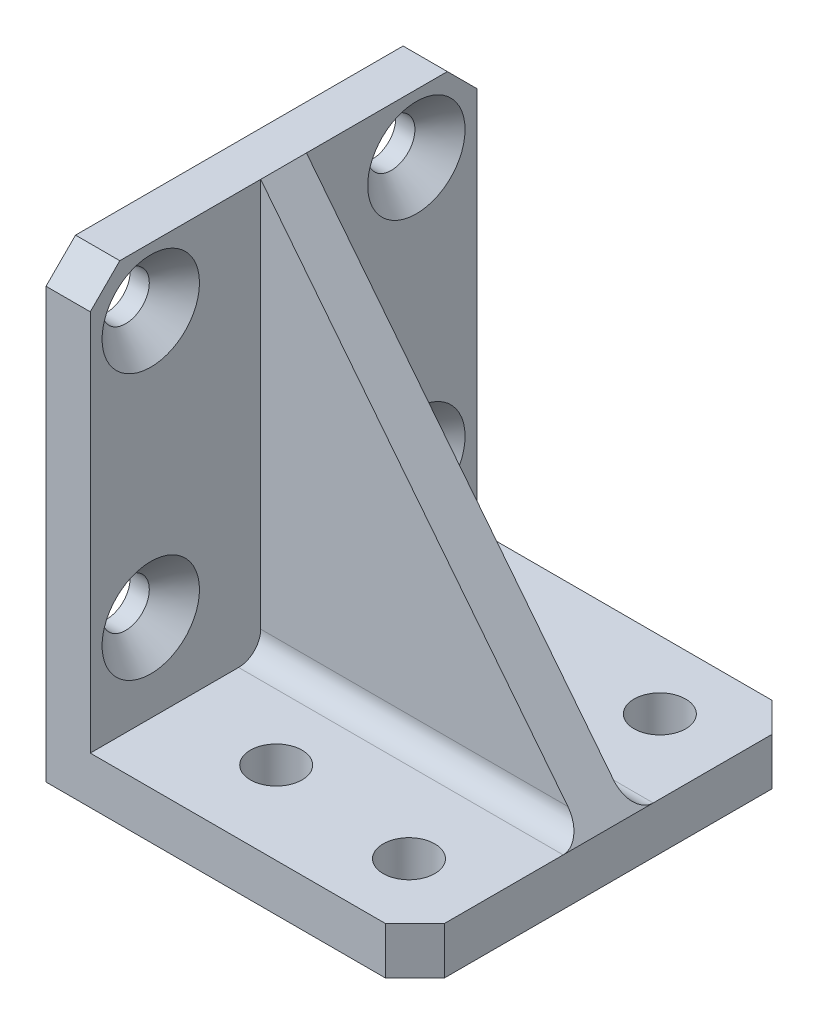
ISO-10303-21;
HEADER;
FILE_DESCRIPTION(('STEP AP214'),'2;1');
FILE_NAME('part.step','',(''),(''),'','','');
FILE_SCHEMA(('AUTOMOTIVE_DESIGN { 1 0 10303 214 1 1 1 1 }'));
ENDSEC;
DATA;
#1=APPLICATION_CONTEXT('core data for automotive mechanical design processes');
#2=APPLICATION_PROTOCOL_DEFINITION('international standard','automotive_design',2000,#1);
#3=PRODUCT_CONTEXT('',#1,'mechanical');
#4=PRODUCT('Part','Part','',(#3));
#5=PRODUCT_RELATED_PRODUCT_CATEGORY('part','',(#4));
#6=PRODUCT_DEFINITION_FORMATION('','',#4);
#7=PRODUCT_DEFINITION_CONTEXT('part definition',#1,'design');
#8=PRODUCT_DEFINITION('design','',#6,#7);
#9=PRODUCT_DEFINITION_SHAPE('','',#8);
#10=(LENGTH_UNIT() NAMED_UNIT(*) SI_UNIT(.MILLI.,.METRE.));
#11=(NAMED_UNIT(*) PLANE_ANGLE_UNIT() SI_UNIT($,.RADIAN.));
#12=(NAMED_UNIT(*) SI_UNIT($,.STERADIAN.) SOLID_ANGLE_UNIT());
#13=UNCERTAINTY_MEASURE_WITH_UNIT(LENGTH_MEASURE(1.E-05),#10,'distance_accuracy_value','');
#14=(GEOMETRIC_REPRESENTATION_CONTEXT(3) GLOBAL_UNCERTAINTY_ASSIGNED_CONTEXT((#13)) GLOBAL_UNIT_ASSIGNED_CONTEXT((#10,
#11,#12)) REPRESENTATION_CONTEXT('',''));
#15=CARTESIAN_POINT('',(0.,0.,0.));
#16=DIRECTION('',(0.,0.,1.));
#17=DIRECTION('',(1.,0.,0.));
#18=AXIS2_PLACEMENT_3D('',#15,#16,#17);
#19=CARTESIAN_POINT('',(3.,3.2,13.1));
#20=DIRECTION('',(-1.,0.,0.));
#21=DIRECTION('',(0.,0.,1.));
#22=AXIS2_PLACEMENT_3D('',#19,#20,#21);
#23=PLANE('',#22);
#24=CARTESIAN_POINT('',(3.,27.1,-9.));
#25=DIRECTION('',(1.,0.,0.));
#26=DIRECTION('',(0.,0.,-1.));
#27=AXIS2_PLACEMENT_3D('',#24,#25,#26);
#28=CIRCLE('',#27,3.3);
#29=CARTESIAN_POINT('',(3.,27.1,-12.3));
#30=VERTEX_POINT('',#29);
#31=EDGE_CURVE('E660',#30,#30,#28,.T.);
#32=ORIENTED_EDGE('',*,*,#31,.F.);
#33=EDGE_LOOP('',(#32));
#34=FACE_BOUND('',#33,.T.);
#35=DIRECTION('',(0.,-1.,0.));
#36=VECTOR('',#35,1.);
#37=CARTESIAN_POINT('',(3.,31.1,-1.55));
#38=LINE('',#37,#36);
#39=CARTESIAN_POINT('',(3.,31.1,-1.55));
#40=VERTEX_POINT('',#39);
#41=CARTESIAN_POINT('',(3.,4.7,-1.55));
#42=VERTEX_POINT('',#41);
#43=EDGE_CURVE('E112',#40,#42,#38,.T.);
#44=ORIENTED_EDGE('',*,*,#43,.T.);
#45=CARTESIAN_POINT('',(3.,4.7,-3.05));
#46=DIRECTION('',(-1.,0.,0.));
#47=DIRECTION('',(0.,0.,1.));
#48=AXIS2_PLACEMENT_3D('',#45,#46,#47);
#49=CIRCLE('',#48,1.5);
#50=CARTESIAN_POINT('',(3.,3.2,-3.05));
#51=VERTEX_POINT('',#50);
#52=EDGE_CURVE('E105',#42,#51,#49,.F.);
#53=ORIENTED_EDGE('',*,*,#52,.T.);
#54=DIRECTION('',(0.,0.,-1.));
#55=VECTOR('',#54,1.);
#56=CARTESIAN_POINT('',(3.,3.2,13.1));
#57=LINE('',#56,#55);
#58=CARTESIAN_POINT('',(3.,3.2,-13.1));
#59=VERTEX_POINT('',#58);
#60=EDGE_CURVE('E190',#51,#59,#57,.T.);
#61=ORIENTED_EDGE('',*,*,#60,.T.);
#62=DIRECTION('',(0.,1.,0.));
#63=VECTOR('',#62,1.);
#64=CARTESIAN_POINT('',(3.,3.2,-13.1));
#65=LINE('',#64,#63);
#66=CARTESIAN_POINT('',(3.,29.1,-13.1));
#67=VERTEX_POINT('',#66);
#68=EDGE_CURVE('E166',#59,#67,#65,.T.);
#69=ORIENTED_EDGE('',*,*,#68,.T.);
#70=DIRECTION('',(0.,-0.707106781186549,-0.707106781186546));
#71=VECTOR('',#70,1.);
#72=CARTESIAN_POINT('',(3.,31.1,-11.1));
#73=LINE('',#72,#71);
#74=CARTESIAN_POINT('',(3.,31.1,-11.1));
#75=VERTEX_POINT('',#74);
#76=EDGE_CURVE('E228',#67,#75,#73,.F.);
#77=ORIENTED_EDGE('',*,*,#76,.T.);
#78=DIRECTION('',(0.,0.,-1.));
#79=VECTOR('',#78,1.);
#80=CARTESIAN_POINT('',(3.,31.1,13.1));
#81=LINE('',#80,#79);
#82=EDGE_CURVE('E187',#40,#75,#81,.T.);
#83=ORIENTED_EDGE('',*,*,#82,.F.);
#84=EDGE_LOOP('',(#44,#53,#61,#69,#77,#83));
#85=FACE_BOUND('',#84,.T.);
#86=CARTESIAN_POINT('',(3.,9.1,-9.));
#87=DIRECTION('',(1.,0.,0.));
#88=DIRECTION('',(0.,0.,-1.));
#89=AXIS2_PLACEMENT_3D('',#86,#87,#88);
#90=CIRCLE('',#89,3.3);
#91=CARTESIAN_POINT('',(3.,9.1,-12.3));
#92=VERTEX_POINT('',#91);
#93=EDGE_CURVE('E650',#92,#92,#90,.T.);
#94=ORIENTED_EDGE('',*,*,#93,.F.);
#95=EDGE_LOOP('',(#94));
#96=FACE_BOUND('',#95,.T.);
#97=ADVANCED_FACE('F34',(#34,#85,#96),#23,.F.);
#98=CARTESIAN_POINT('',(3.,9.1,9.));
#99=DIRECTION('',(1.,0.,0.));
#100=DIRECTION('',(0.,0.,-1.));
#101=AXIS2_PLACEMENT_3D('',#98,#99,#100);
#102=CIRCLE('',#101,3.3);
#103=CARTESIAN_POINT('',(3.,9.1,5.7));
#104=VERTEX_POINT('',#103);
#105=EDGE_CURVE('E665',#104,#104,#102,.T.);
#106=ORIENTED_EDGE('',*,*,#105,.F.);
#107=EDGE_LOOP('',(#106));
#108=FACE_BOUND('',#107,.T.);
#109=CARTESIAN_POINT('',(3.,3.2,13.1));
#110=VERTEX_POINT('',#109);
#111=CARTESIAN_POINT('',(3.,3.2,3.05));
#112=VERTEX_POINT('',#111);
#113=EDGE_CURVE('E191',#110,#112,#57,.T.);
#114=ORIENTED_EDGE('',*,*,#113,.T.);
#115=CARTESIAN_POINT('',(3.,4.7,3.05));
#116=DIRECTION('',(-1.,0.,0.));
#117=DIRECTION('',(0.,0.,1.));
#118=AXIS2_PLACEMENT_3D('',#115,#116,#117);
#119=CIRCLE('',#118,1.5);
#120=CARTESIAN_POINT('',(3.,4.7,1.55));
#121=VERTEX_POINT('',#120);
#122=EDGE_CURVE('E253',#112,#121,#119,.F.);
#123=ORIENTED_EDGE('',*,*,#122,.T.);
#124=DIRECTION('',(0.,-1.,0.));
#125=VECTOR('',#124,1.);
#126=CARTESIAN_POINT('',(3.,31.1,1.55));
#127=LINE('',#126,#125);
#128=CARTESIAN_POINT('',(3.,31.1,1.55));
#129=VERTEX_POINT('',#128);
#130=EDGE_CURVE('E104',#129,#121,#127,.T.);
#131=ORIENTED_EDGE('',*,*,#130,.F.);
#132=CARTESIAN_POINT('',(3.,31.1,11.1));
#133=VERTEX_POINT('',#132);
#134=EDGE_CURVE('E188',#133,#129,#81,.T.);
#135=ORIENTED_EDGE('',*,*,#134,.F.);
#136=DIRECTION('',(0.,-0.707106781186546,0.707106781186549));
#137=VECTOR('',#136,1.);
#138=CARTESIAN_POINT('',(3.,29.1,13.1));
#139=LINE('',#138,#137);
#140=CARTESIAN_POINT('',(3.,29.1,13.1));
#141=VERTEX_POINT('',#140);
#142=EDGE_CURVE('E219',#133,#141,#139,.T.);
#143=ORIENTED_EDGE('',*,*,#142,.T.);
#144=DIRECTION('',(0.,1.,0.));
#145=VECTOR('',#144,1.);
#146=CARTESIAN_POINT('',(3.,3.2,13.1));
#147=LINE('',#146,#145);
#148=EDGE_CURVE('E172',#110,#141,#147,.T.);
#149=ORIENTED_EDGE('',*,*,#148,.F.);
#150=EDGE_LOOP('',(#114,#123,#131,#135,#143,#149));
#151=FACE_BOUND('',#150,.T.);
#152=CARTESIAN_POINT('',(3.,27.1,9.));
#153=DIRECTION('',(1.,0.,0.));
#154=DIRECTION('',(0.,0.,-1.));
#155=AXIS2_PLACEMENT_3D('',#152,#153,#154);
#156=CIRCLE('',#155,3.3);
#157=CARTESIAN_POINT('',(3.,27.1,5.7));
#158=VERTEX_POINT('',#157);
#159=EDGE_CURVE('E652',#158,#158,#156,.T.);
#160=ORIENTED_EDGE('',*,*,#159,.F.);
#161=EDGE_LOOP('',(#160));
#162=FACE_BOUND('',#161,.T.);
#163=ADVANCED_FACE('F327',(#108,#151,#162),#23,.F.);
#164=CARTESIAN_POINT('',(25.,3.2,13.1));
#165=DIRECTION('',(0.,-1.,0.));
#166=DIRECTION('',(1.,0.,0.));
#167=AXIS2_PLACEMENT_3D('',#164,#165,#166);
#168=PLANE('',#167);
#169=CARTESIAN_POINT('',(20.,3.2,8.5));
#170=DIRECTION('',(0.,-1.,0.));
#171=DIRECTION('',(1.,0.,0.));
#172=AXIS2_PLACEMENT_3D('',#169,#170,#171);
#173=CIRCLE('',#172,1.75);
#174=CARTESIAN_POINT('',(21.75,3.2,8.5));
#175=VERTEX_POINT('',#174);
#176=EDGE_CURVE('E146',#175,#175,#173,.F.);
#177=ORIENTED_EDGE('',*,*,#176,.F.);
#178=EDGE_LOOP('',(#177));
#179=FACE_BOUND('',#178,.T.);
#180=CARTESIAN_POINT('',(10.,3.2,7.5));
#181=DIRECTION('',(0.,-1.,0.));
#182=DIRECTION('',(1.,0.,0.));
#183=AXIS2_PLACEMENT_3D('',#180,#181,#182);
#184=CIRCLE('',#183,1.75);
#185=CARTESIAN_POINT('',(11.75,3.2,7.5));
#186=VERTEX_POINT('',#185);
#187=EDGE_CURVE('E152',#186,#186,#184,.F.);
#188=ORIENTED_EDGE('',*,*,#187,.F.);
#189=EDGE_LOOP('',(#188));
#190=FACE_BOUND('',#189,.T.);
#191=DIRECTION('',(0.,0.,-1.));
#192=VECTOR('',#191,1.);
#193=CARTESIAN_POINT('',(25.,3.2,13.1));
#194=LINE('',#193,#192);
#195=CARTESIAN_POINT('',(25.,3.2,11.1));
#196=VERTEX_POINT('',#195);
#197=CARTESIAN_POINT('',(25.,3.2,3.05));
#198=VERTEX_POINT('',#197);
#199=EDGE_CURVE('E194',#196,#198,#194,.T.);
#200=ORIENTED_EDGE('',*,*,#199,.T.);
#201=DIRECTION('',(1.,0.,0.));
#202=VECTOR('',#201,1.);
#203=CARTESIAN_POINT('',(3.,3.2,3.05));
#204=LINE('',#203,#202);
#205=EDGE_CURVE('E57',#198,#112,#204,.F.);
#206=ORIENTED_EDGE('',*,*,#205,.T.);
#207=ORIENTED_EDGE('',*,*,#113,.F.);
#208=DIRECTION('',(-1.,0.,0.));
#209=VECTOR('',#208,1.);
#210=CARTESIAN_POINT('',(25.,3.2,13.1));
#211=LINE('',#210,#209);
#212=CARTESIAN_POINT('',(23.,3.2,13.1));
#213=VERTEX_POINT('',#212);
#214=EDGE_CURVE('E169',#213,#110,#211,.T.);
#215=ORIENTED_EDGE('',*,*,#214,.F.);
#216=DIRECTION('',(0.707106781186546,0.,-0.707106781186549));
#217=VECTOR('',#216,1.);
#218=CARTESIAN_POINT('',(23.,3.2,13.1));
#219=LINE('',#218,#217);
#220=EDGE_CURVE('E243',#213,#196,#219,.T.);
#221=ORIENTED_EDGE('',*,*,#220,.T.);
#222=EDGE_LOOP('',(#200,#206,#207,#215,#221));
#223=FACE_BOUND('',#222,.T.);
#224=ADVANCED_FACE('F345',(#179,#190,#223),#168,.F.);
#225=CARTESIAN_POINT('',(0.,31.1,13.1));
#226=DIRECTION('',(1.,0.,0.));
#227=DIRECTION('',(0.,1.,0.));
#228=AXIS2_PLACEMENT_3D('',#225,#226,#227);
#229=PLANE('',#228);
#230=CARTESIAN_POINT('',(0.,9.1,9.));
#231=DIRECTION('',(-1.,0.,0.));
#232=DIRECTION('',(0.,-1.,0.));
#233=AXIS2_PLACEMENT_3D('',#230,#231,#232);
#234=CIRCLE('',#233,1.6);
#235=CARTESIAN_POINT('',(0.,7.5,9.));
#236=VERTEX_POINT('',#235);
#237=EDGE_CURVE('E125',#236,#236,#234,.T.);
#238=ORIENTED_EDGE('',*,*,#237,.F.);
#239=EDGE_LOOP('',(#238));
#240=FACE_BOUND('',#239,.T.);
#241=CARTESIAN_POINT('',(0.,9.1,-9.));
#242=DIRECTION('',(-1.,0.,0.));
#243=DIRECTION('',(0.,-1.,0.));
#244=AXIS2_PLACEMENT_3D('',#241,#242,#243);
#245=CIRCLE('',#244,1.6);
#246=CARTESIAN_POINT('',(0.,7.5,-9.));
#247=VERTEX_POINT('',#246);
#248=EDGE_CURVE('E128',#247,#247,#245,.T.);
#249=ORIENTED_EDGE('',*,*,#248,.F.);
#250=EDGE_LOOP('',(#249));
#251=FACE_BOUND('',#250,.T.);
#252=CARTESIAN_POINT('',(0.,27.1,9.));
#253=DIRECTION('',(-1.,0.,0.));
#254=DIRECTION('',(0.,-1.,0.));
#255=AXIS2_PLACEMENT_3D('',#252,#253,#254);
#256=CIRCLE('',#255,1.6);
#257=CARTESIAN_POINT('',(0.,25.5,9.));
#258=VERTEX_POINT('',#257);
#259=EDGE_CURVE('E131',#258,#258,#256,.T.);
#260=ORIENTED_EDGE('',*,*,#259,.F.);
#261=EDGE_LOOP('',(#260));
#262=FACE_BOUND('',#261,.T.);
#263=CARTESIAN_POINT('',(0.,27.1,-9.));
#264=DIRECTION('',(-1.,0.,0.));
#265=DIRECTION('',(0.,-1.,0.));
#266=AXIS2_PLACEMENT_3D('',#263,#264,#265);
#267=CIRCLE('',#266,1.6);
#268=CARTESIAN_POINT('',(0.,25.5,-9.));
#269=VERTEX_POINT('',#268);
#270=EDGE_CURVE('E134',#269,#269,#267,.T.);
#271=ORIENTED_EDGE('',*,*,#270,.F.);
#272=EDGE_LOOP('',(#271));
#273=FACE_BOUND('',#272,.T.);
#274=DIRECTION('',(0.,-1.,0.));
#275=VECTOR('',#274,1.);
#276=CARTESIAN_POINT('',(0.,31.1,13.1));
#277=LINE('',#276,#275);
#278=CARTESIAN_POINT('',(0.,29.1,13.1));
#279=VERTEX_POINT('',#278);
#280=CARTESIAN_POINT('',(0.,0.,13.1));
#281=VERTEX_POINT('',#280);
#282=EDGE_CURVE('E162',#279,#281,#277,.T.);
#283=ORIENTED_EDGE('',*,*,#282,.F.);
#284=DIRECTION('',(0.,0.707106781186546,-0.707106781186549));
#285=VECTOR('',#284,1.);
#286=CARTESIAN_POINT('',(0.,29.1,13.1));
#287=LINE('',#286,#285);
#288=CARTESIAN_POINT('',(0.,31.1,11.1));
#289=VERTEX_POINT('',#288);
#290=EDGE_CURVE('E210',#279,#289,#287,.T.);
#291=ORIENTED_EDGE('',*,*,#290,.T.);
#292=DIRECTION('',(0.,0.,-1.));
#293=VECTOR('',#292,1.);
#294=CARTESIAN_POINT('',(0.,31.1,13.1));
#295=LINE('',#294,#293);
#296=CARTESIAN_POINT('',(0.,31.1,-11.1));
#297=VERTEX_POINT('',#296);
#298=EDGE_CURVE('E175',#289,#297,#295,.T.);
#299=ORIENTED_EDGE('',*,*,#298,.T.);
#300=DIRECTION('',(0.,0.707106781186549,0.707106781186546));
#301=VECTOR('',#300,1.);
#302=CARTESIAN_POINT('',(0.,31.1,-11.1));
#303=LINE('',#302,#301);
#304=CARTESIAN_POINT('',(0.,29.1,-13.1));
#305=VERTEX_POINT('',#304);
#306=EDGE_CURVE('E207',#297,#305,#303,.F.);
#307=ORIENTED_EDGE('',*,*,#306,.T.);
#308=DIRECTION('',(0.,-1.,0.));
#309=VECTOR('',#308,1.);
#310=CARTESIAN_POINT('',(0.,31.1,-13.1));
#311=LINE('',#310,#309);
#312=CARTESIAN_POINT('',(0.,0.,-13.1));
#313=VERTEX_POINT('',#312);
#314=EDGE_CURVE('E161',#305,#313,#311,.T.);
#315=ORIENTED_EDGE('',*,*,#314,.T.);
#316=DIRECTION('',(0.,0.,-1.));
#317=VECTOR('',#316,1.);
#318=CARTESIAN_POINT('',(0.,0.,13.1));
#319=LINE('',#318,#317);
#320=EDGE_CURVE('E198',#281,#313,#319,.T.);
#321=ORIENTED_EDGE('',*,*,#320,.F.);
#322=EDGE_LOOP('',(#283,#291,#299,#307,#315,#321));
#323=FACE_BOUND('',#322,.T.);
#324=ADVANCED_FACE('F306',(#240,#251,#262,#273,#323),#229,.F.);
#325=CARTESIAN_POINT('',(0.,0.,13.1));
#326=DIRECTION('',(0.,1.,0.));
#327=DIRECTION('',(0.,0.,1.));
#328=AXIS2_PLACEMENT_3D('',#325,#326,#327);
#329=PLANE('',#328);
#330=CARTESIAN_POINT('',(20.,0.,-8.5));
#331=DIRECTION('',(0.,-1.,0.));
#332=DIRECTION('',(0.,0.,-1.));
#333=AXIS2_PLACEMENT_3D('',#330,#331,#332);
#334=CIRCLE('',#333,1.75);
#335=CARTESIAN_POINT('',(20.,0.,-10.25));
#336=VERTEX_POINT('',#335);
#337=EDGE_CURVE('E137',#336,#336,#334,.T.);
#338=ORIENTED_EDGE('',*,*,#337,.F.);
#339=EDGE_LOOP('',(#338));
#340=FACE_BOUND('',#339,.T.);
#341=CARTESIAN_POINT('',(20.,0.,8.5));
#342=DIRECTION('',(0.,-1.,0.));
#343=DIRECTION('',(0.,0.,-1.));
#344=AXIS2_PLACEMENT_3D('',#341,#342,#343);
#345=CIRCLE('',#344,1.75);
#346=CARTESIAN_POINT('',(20.,0.,6.75));
#347=VERTEX_POINT('',#346);
#348=EDGE_CURVE('E143',#347,#347,#345,.T.);
#349=ORIENTED_EDGE('',*,*,#348,.F.);
#350=EDGE_LOOP('',(#349));
#351=FACE_BOUND('',#350,.T.);
#352=CARTESIAN_POINT('',(10.,0.,7.5));
#353=DIRECTION('',(0.,-1.,0.));
#354=DIRECTION('',(0.,0.,-1.));
#355=AXIS2_PLACEMENT_3D('',#352,#353,#354);
#356=CIRCLE('',#355,1.75);
#357=CARTESIAN_POINT('',(10.,0.,5.75));
#358=VERTEX_POINT('',#357);
#359=EDGE_CURVE('E149',#358,#358,#356,.T.);
#360=ORIENTED_EDGE('',*,*,#359,.F.);
#361=EDGE_LOOP('',(#360));
#362=FACE_BOUND('',#361,.T.);
#363=CARTESIAN_POINT('',(10.,0.,-7.5));
#364=DIRECTION('',(0.,-1.,0.));
#365=DIRECTION('',(0.,0.,-1.));
#366=AXIS2_PLACEMENT_3D('',#363,#364,#365);
#367=CIRCLE('',#366,1.75);
#368=CARTESIAN_POINT('',(10.,0.,-9.25));
#369=VERTEX_POINT('',#368);
#370=EDGE_CURVE('E155',#369,#369,#367,.T.);
#371=ORIENTED_EDGE('',*,*,#370,.F.);
#372=EDGE_LOOP('',(#371));
#373=FACE_BOUND('',#372,.T.);
#374=DIRECTION('',(1.,0.,0.));
#375=VECTOR('',#374,1.);
#376=CARTESIAN_POINT('',(0.,0.,-13.1));
#377=LINE('',#376,#375);
#378=CARTESIAN_POINT('',(23.,0.,-13.1));
#379=VERTEX_POINT('',#378);
#380=EDGE_CURVE('E178',#313,#379,#377,.T.);
#381=ORIENTED_EDGE('',*,*,#380,.T.);
#382=DIRECTION('',(-0.707106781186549,0.,-0.707106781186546));
#383=VECTOR('',#382,1.);
#384=CARTESIAN_POINT('',(25.,0.,-11.1));
#385=LINE('',#384,#383);
#386=CARTESIAN_POINT('',(25.,0.,-11.1));
#387=VERTEX_POINT('',#386);
#388=EDGE_CURVE('E79',#379,#387,#385,.F.);
#389=ORIENTED_EDGE('',*,*,#388,.T.);
#390=DIRECTION('',(0.,0.,-1.));
#391=VECTOR('',#390,1.);
#392=CARTESIAN_POINT('',(25.,0.,13.1));
#393=LINE('',#392,#391);
#394=CARTESIAN_POINT('',(25.,0.,11.1));
#395=VERTEX_POINT('',#394);
#396=EDGE_CURVE('E196',#395,#387,#393,.T.);
#397=ORIENTED_EDGE('',*,*,#396,.F.);
#398=DIRECTION('',(-0.707106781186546,0.,0.707106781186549));
#399=VECTOR('',#398,1.);
#400=CARTESIAN_POINT('',(23.,0.,13.1));
#401=LINE('',#400,#399);
#402=CARTESIAN_POINT('',(23.,0.,13.1));
#403=VERTEX_POINT('',#402);
#404=EDGE_CURVE('E239',#395,#403,#401,.T.);
#405=ORIENTED_EDGE('',*,*,#404,.T.);
#406=DIRECTION('',(1.,0.,0.));
#407=VECTOR('',#406,1.);
#408=CARTESIAN_POINT('',(0.,0.,13.1));
#409=LINE('',#408,#407);
#410=EDGE_CURVE('E165',#281,#403,#409,.T.);
#411=ORIENTED_EDGE('',*,*,#410,.F.);
#412=ORIENTED_EDGE('',*,*,#320,.T.);
#413=EDGE_LOOP('',(#381,#389,#397,#405,#411,#412));
#414=FACE_BOUND('',#413,.T.);
#415=ADVANCED_FACE('F352',(#340,#351,#362,#373,#414),#329,.F.);
#416=CARTESIAN_POINT('',(25.,0.,13.1));
#417=DIRECTION('',(-1.,0.,0.));
#418=DIRECTION('',(0.,0.,1.));
#419=AXIS2_PLACEMENT_3D('',#416,#417,#418);
#420=PLANE('',#419);
#421=ORIENTED_EDGE('',*,*,#396,.T.);
#422=DIRECTION('',(0.,1.,0.));
#423=VECTOR('',#422,1.);
#424=CARTESIAN_POINT('',(25.,0.,-11.1));
#425=LINE('',#424,#423);
#426=CARTESIAN_POINT('',(25.,3.2,-11.1));
#427=VERTEX_POINT('',#426);
#428=EDGE_CURVE('E233',#387,#427,#425,.T.);
#429=ORIENTED_EDGE('',*,*,#428,.T.);
#430=CARTESIAN_POINT('',(25.,3.2,-3.05));
#431=VERTEX_POINT('',#430);
#432=EDGE_CURVE('E193',#431,#427,#194,.T.);
#433=ORIENTED_EDGE('',*,*,#432,.F.);
#434=DIRECTION('',(0.,0.,-1.));
#435=VECTOR('',#434,1.);
#436=CARTESIAN_POINT('',(25.,3.2,1.55));
#437=LINE('',#436,#435);
#438=EDGE_CURVE('E49',#198,#431,#437,.T.);
#439=ORIENTED_EDGE('',*,*,#438,.F.);
#440=ORIENTED_EDGE('',*,*,#199,.F.);
#441=DIRECTION('',(0.,-1.,0.));
#442=VECTOR('',#441,1.);
#443=CARTESIAN_POINT('',(25.,0.,11.1));
#444=LINE('',#443,#442);
#445=EDGE_CURVE('E231',#196,#395,#444,.T.);
#446=ORIENTED_EDGE('',*,*,#445,.T.);
#447=EDGE_LOOP('',(#421,#429,#433,#439,#440,#446));
#448=FACE_BOUND('',#447,.T.);
#449=ADVANCED_FACE('F349',(#448),#420,.F.);
#450=CARTESIAN_POINT('',(20.,3.2,-8.5));
#451=DIRECTION('',(0.,-1.,0.));
#452=DIRECTION('',(1.,0.,0.));
#453=AXIS2_PLACEMENT_3D('',#450,#451,#452);
#454=CIRCLE('',#453,1.75);
#455=CARTESIAN_POINT('',(21.75,3.2,-8.5));
#456=VERTEX_POINT('',#455);
#457=EDGE_CURVE('E140',#456,#456,#454,.F.);
#458=ORIENTED_EDGE('',*,*,#457,.F.);
#459=EDGE_LOOP('',(#458));
#460=FACE_BOUND('',#459,.T.);
#461=CARTESIAN_POINT('',(10.,3.2,-7.5));
#462=DIRECTION('',(0.,-1.,0.));
#463=DIRECTION('',(1.,0.,0.));
#464=AXIS2_PLACEMENT_3D('',#461,#462,#463);
#465=CIRCLE('',#464,1.75);
#466=CARTESIAN_POINT('',(11.75,3.2,-7.5));
#467=VERTEX_POINT('',#466);
#468=EDGE_CURVE('E158',#467,#467,#465,.F.);
#469=ORIENTED_EDGE('',*,*,#468,.F.);
#470=EDGE_LOOP('',(#469));
#471=FACE_BOUND('',#470,.T.);
#472=ORIENTED_EDGE('',*,*,#60,.F.);
#473=DIRECTION('',(1.,0.,0.));
#474=VECTOR('',#473,1.);
#475=CARTESIAN_POINT('',(25.,3.2,-3.05));
#476=LINE('',#475,#474);
#477=EDGE_CURVE('E246',#51,#431,#476,.T.);
#478=ORIENTED_EDGE('',*,*,#477,.T.);
#479=ORIENTED_EDGE('',*,*,#432,.T.);
#480=DIRECTION('',(0.707106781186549,0.,0.707106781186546));
#481=VECTOR('',#480,1.);
#482=CARTESIAN_POINT('',(25.,3.2,-11.1));
#483=LINE('',#482,#481);
#484=CARTESIAN_POINT('',(23.,3.2,-13.1));
#485=VERTEX_POINT('',#484);
#486=EDGE_CURVE('E236',#427,#485,#483,.F.);
#487=ORIENTED_EDGE('',*,*,#486,.T.);
#488=DIRECTION('',(-1.,0.,0.));
#489=VECTOR('',#488,1.);
#490=CARTESIAN_POINT('',(25.,3.2,-13.1));
#491=LINE('',#490,#489);
#492=EDGE_CURVE('E180',#485,#59,#491,.T.);
#493=ORIENTED_EDGE('',*,*,#492,.T.);
#494=EDGE_LOOP('',(#472,#478,#479,#487,#493));
#495=FACE_BOUND('',#494,.T.);
#496=ADVANCED_FACE('F271',(#460,#471,#495),#168,.F.);
#497=CARTESIAN_POINT('',(3.,31.1,13.1));
#498=DIRECTION('',(0.,-1.,0.));
#499=DIRECTION('',(0.,0.,-1.));
#500=AXIS2_PLACEMENT_3D('',#497,#498,#499);
#501=PLANE('',#500);
#502=ORIENTED_EDGE('',*,*,#298,.F.);
#503=DIRECTION('',(1.,0.,0.));
#504=VECTOR('',#503,1.);
#505=CARTESIAN_POINT('',(3.,31.1,11.1));
#506=LINE('',#505,#504);
#507=EDGE_CURVE('E216',#289,#133,#506,.T.);
#508=ORIENTED_EDGE('',*,*,#507,.T.);
#509=ORIENTED_EDGE('',*,*,#134,.T.);
#510=DIRECTION('',(0.,0.,-1.));
#511=VECTOR('',#510,1.);
#512=CARTESIAN_POINT('',(3.,31.1,1.55));
#513=LINE('',#512,#511);
#514=EDGE_CURVE('E111',#129,#40,#513,.T.);
#515=ORIENTED_EDGE('',*,*,#514,.T.);
#516=ORIENTED_EDGE('',*,*,#82,.T.);
#517=DIRECTION('',(-1.,0.,0.));
#518=VECTOR('',#517,1.);
#519=CARTESIAN_POINT('',(3.,31.1,-11.1));
#520=LINE('',#519,#518);
#521=EDGE_CURVE('E213',#75,#297,#520,.T.);
#522=ORIENTED_EDGE('',*,*,#521,.T.);
#523=EDGE_LOOP('',(#502,#508,#509,#515,#516,#522));
#524=FACE_BOUND('',#523,.T.);
#525=ADVANCED_FACE('F300',(#524),#501,.F.);
#526=CARTESIAN_POINT('',(0.,0.,13.1));
#527=DIRECTION('',(0.,0.,1.));
#528=DIRECTION('',(1.,0.,0.));
#529=AXIS2_PLACEMENT_3D('',#526,#527,#528);
#530=PLANE('',#529);
#531=ORIENTED_EDGE('',*,*,#148,.T.);
#532=DIRECTION('',(-1.,0.,0.));
#533=VECTOR('',#532,1.);
#534=CARTESIAN_POINT('',(0.,29.1,13.1));
#535=LINE('',#534,#533);
#536=EDGE_CURVE('E204',#141,#279,#535,.T.);
#537=ORIENTED_EDGE('',*,*,#536,.T.);
#538=ORIENTED_EDGE('',*,*,#282,.T.);
#539=ORIENTED_EDGE('',*,*,#410,.T.);
#540=DIRECTION('',(0.,1.,0.));
#541=VECTOR('',#540,1.);
#542=CARTESIAN_POINT('',(23.,3.2,13.1));
#543=LINE('',#542,#541);
#544=EDGE_CURVE('E201',#403,#213,#543,.T.);
#545=ORIENTED_EDGE('',*,*,#544,.T.);
#546=ORIENTED_EDGE('',*,*,#214,.T.);
#547=EDGE_LOOP('',(#531,#537,#538,#539,#545,#546));
#548=FACE_BOUND('',#547,.T.);
#549=ADVANCED_FACE('F319',(#548),#530,.T.);
#550=CARTESIAN_POINT('',(0.,0.,-13.1));
#551=DIRECTION('',(0.,0.,1.));
#552=DIRECTION('',(1.,0.,0.));
#553=AXIS2_PLACEMENT_3D('',#550,#551,#552);
#554=PLANE('',#553);
#555=ORIENTED_EDGE('',*,*,#314,.F.);
#556=DIRECTION('',(1.,0.,0.));
#557=VECTOR('',#556,1.);
#558=CARTESIAN_POINT('',(0.,29.1,-13.1));
#559=LINE('',#558,#557);
#560=EDGE_CURVE('E225',#305,#67,#559,.T.);
#561=ORIENTED_EDGE('',*,*,#560,.T.);
#562=ORIENTED_EDGE('',*,*,#68,.F.);
#563=ORIENTED_EDGE('',*,*,#492,.F.);
#564=DIRECTION('',(0.,-1.,0.));
#565=VECTOR('',#564,1.);
#566=CARTESIAN_POINT('',(23.,0.,-13.1));
#567=LINE('',#566,#565);
#568=EDGE_CURVE('E222',#485,#379,#567,.T.);
#569=ORIENTED_EDGE('',*,*,#568,.T.);
#570=ORIENTED_EDGE('',*,*,#380,.F.);
#571=EDGE_LOOP('',(#555,#561,#562,#563,#569,#570));
#572=FACE_BOUND('',#571,.T.);
#573=ADVANCED_FACE('F283',(#572),#554,.F.);
#574=CARTESIAN_POINT('',(10.,8.14974746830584,-7.5));
#575=DIRECTION('',(0.,-1.,0.));
#576=DIRECTION('',(0.,0.,-1.));
#577=AXIS2_PLACEMENT_3D('',#574,#575,#576);
#578=CYLINDRICAL_SURFACE('',#577,1.75);
#579=ORIENTED_EDGE('',*,*,#468,.T.);
#580=EDGE_LOOP('',(#579));
#581=FACE_BOUND('',#580,.T.);
#582=ORIENTED_EDGE('',*,*,#370,.T.);
#583=EDGE_LOOP('',(#582));
#584=FACE_BOUND('',#583,.T.);
#585=ADVANCED_FACE('F427',(#581,#584),#578,.F.);
#586=CARTESIAN_POINT('',(10.,8.14974746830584,7.5));
#587=DIRECTION('',(0.,-1.,0.));
#588=DIRECTION('',(0.,0.,-1.));
#589=AXIS2_PLACEMENT_3D('',#586,#587,#588);
#590=CYLINDRICAL_SURFACE('',#589,1.75);
#591=ORIENTED_EDGE('',*,*,#187,.T.);
#592=EDGE_LOOP('',(#591));
#593=FACE_BOUND('',#592,.T.);
#594=ORIENTED_EDGE('',*,*,#359,.T.);
#595=EDGE_LOOP('',(#594));
#596=FACE_BOUND('',#595,.T.);
#597=ADVANCED_FACE('F423',(#593,#596),#590,.F.);
#598=CARTESIAN_POINT('',(20.,8.14974746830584,8.5));
#599=DIRECTION('',(0.,-1.,0.));
#600=DIRECTION('',(0.,0.,-1.));
#601=AXIS2_PLACEMENT_3D('',#598,#599,#600);
#602=CYLINDRICAL_SURFACE('',#601,1.75);
#603=ORIENTED_EDGE('',*,*,#176,.T.);
#604=EDGE_LOOP('',(#603));
#605=FACE_BOUND('',#604,.T.);
#606=ORIENTED_EDGE('',*,*,#348,.T.);
#607=EDGE_LOOP('',(#606));
#608=FACE_BOUND('',#607,.T.);
#609=ADVANCED_FACE('F419',(#605,#608),#602,.F.);
#610=CARTESIAN_POINT('',(20.,8.14974746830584,-8.5));
#611=DIRECTION('',(0.,-1.,0.));
#612=DIRECTION('',(0.,0.,-1.));
#613=AXIS2_PLACEMENT_3D('',#610,#611,#612);
#614=CYLINDRICAL_SURFACE('',#613,1.75);
#615=ORIENTED_EDGE('',*,*,#457,.T.);
#616=EDGE_LOOP('',(#615));
#617=FACE_BOUND('',#616,.T.);
#618=ORIENTED_EDGE('',*,*,#337,.T.);
#619=EDGE_LOOP('',(#618));
#620=FACE_BOUND('',#619,.T.);
#621=ADVANCED_FACE('F415',(#617,#620),#614,.F.);
#622=CARTESIAN_POINT('',(25.001,27.1,-9.));
#623=DIRECTION('',(-1.,0.,0.));
#624=DIRECTION('',(0.,-1.,0.));
#625=AXIS2_PLACEMENT_3D('',#622,#623,#624);
#626=CYLINDRICAL_SURFACE('',#625,1.6);
#627=CARTESIAN_POINT('',(1.3,27.1,-9.));
#628=DIRECTION('',(1.,0.,0.));
#629=DIRECTION('',(0.,0.,-1.));
#630=AXIS2_PLACEMENT_3D('',#627,#628,#629);
#631=CIRCLE('',#630,1.6);
#632=CARTESIAN_POINT('',(1.3,27.1,-10.6));
#633=VERTEX_POINT('',#632);
#634=EDGE_CURVE('E663',#633,#633,#631,.T.);
#635=ORIENTED_EDGE('',*,*,#634,.T.);
#636=EDGE_LOOP('',(#635));
#637=FACE_BOUND('',#636,.T.);
#638=ORIENTED_EDGE('',*,*,#270,.T.);
#639=EDGE_LOOP('',(#638));
#640=FACE_BOUND('',#639,.T.);
#641=ADVANCED_FACE('F411',(#637,#640),#626,.F.);
#642=CARTESIAN_POINT('',(25.001,27.1,9.));
#643=DIRECTION('',(-1.,0.,0.));
#644=DIRECTION('',(0.,-1.,0.));
#645=AXIS2_PLACEMENT_3D('',#642,#643,#644);
#646=CYLINDRICAL_SURFACE('',#645,1.6);
#647=CARTESIAN_POINT('',(1.3,27.1,9.));
#648=DIRECTION('',(1.,0.,0.));
#649=DIRECTION('',(0.,0.,-1.));
#650=AXIS2_PLACEMENT_3D('',#647,#648,#649);
#651=CIRCLE('',#650,1.6);
#652=CARTESIAN_POINT('',(1.3,27.1,7.4));
#653=VERTEX_POINT('',#652);
#654=EDGE_CURVE('E657',#653,#653,#651,.T.);
#655=ORIENTED_EDGE('',*,*,#654,.T.);
#656=EDGE_LOOP('',(#655));
#657=FACE_BOUND('',#656,.T.);
#658=ORIENTED_EDGE('',*,*,#259,.T.);
#659=EDGE_LOOP('',(#658));
#660=FACE_BOUND('',#659,.T.);
#661=ADVANCED_FACE('F407',(#657,#660),#646,.F.);
#662=CARTESIAN_POINT('',(25.001,9.1,-9.));
#663=DIRECTION('',(-1.,0.,0.));
#664=DIRECTION('',(0.,-1.,0.));
#665=AXIS2_PLACEMENT_3D('',#662,#663,#664);
#666=CYLINDRICAL_SURFACE('',#665,1.6);
#667=CARTESIAN_POINT('',(1.3,9.1,-9.));
#668=DIRECTION('',(1.,0.,0.));
#669=DIRECTION('',(0.,0.,-1.));
#670=AXIS2_PLACEMENT_3D('',#667,#668,#669);
#671=CIRCLE('',#670,1.6);
#672=CARTESIAN_POINT('',(1.3,9.1,-10.6));
#673=VERTEX_POINT('',#672);
#674=EDGE_CURVE('E647',#673,#673,#671,.T.);
#675=ORIENTED_EDGE('',*,*,#674,.T.);
#676=EDGE_LOOP('',(#675));
#677=FACE_BOUND('',#676,.T.);
#678=ORIENTED_EDGE('',*,*,#248,.T.);
#679=EDGE_LOOP('',(#678));
#680=FACE_BOUND('',#679,.T.);
#681=ADVANCED_FACE('F403',(#677,#680),#666,.F.);
#682=CARTESIAN_POINT('',(25.001,9.1,9.));
#683=DIRECTION('',(-1.,0.,0.));
#684=DIRECTION('',(0.,-1.,0.));
#685=AXIS2_PLACEMENT_3D('',#682,#683,#684);
#686=CYLINDRICAL_SURFACE('',#685,1.6);
#687=CARTESIAN_POINT('',(1.3,9.1,9.));
#688=DIRECTION('',(1.,0.,0.));
#689=DIRECTION('',(0.,0.,-1.));
#690=AXIS2_PLACEMENT_3D('',#687,#688,#689);
#691=CIRCLE('',#690,1.6);
#692=CARTESIAN_POINT('',(1.3,9.1,7.4));
#693=VERTEX_POINT('',#692);
#694=EDGE_CURVE('E119',#693,#693,#691,.T.);
#695=ORIENTED_EDGE('',*,*,#694,.T.);
#696=EDGE_LOOP('',(#695));
#697=FACE_BOUND('',#696,.T.);
#698=ORIENTED_EDGE('',*,*,#237,.T.);
#699=EDGE_LOOP('',(#698));
#700=FACE_BOUND('',#699,.T.);
#701=ADVANCED_FACE('F400',(#697,#700),#686,.F.);
#702=CARTESIAN_POINT('',(25.,3.2,1.55));
#703=DIRECTION('',(-0.785242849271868,-0.619187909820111,0.));
#704=DIRECTION('',(0.619187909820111,-0.785242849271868,0.));
#705=AXIS2_PLACEMENT_3D('',#702,#703,#704);
#706=PLANE('',#705);
#707=ORIENTED_EDGE('',*,*,#438,.T.);
#708=CARTESIAN_POINT('',(23.8172043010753,4.7,-3.05));
#709=DIRECTION('',(-0.785242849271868,-0.619187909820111,0.));
#710=DIRECTION('',(0.619187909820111,-0.785242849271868,0.));
#711=AXIS2_PLACEMENT_3D('',#708,#709,#710);
#712=ELLIPSE('',#711,1.91023707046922,1.5);
#713=CARTESIAN_POINT('',(23.8172043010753,4.7,-1.55));
#714=VERTEX_POINT('',#713);
#715=EDGE_CURVE('E42',#431,#714,#712,.T.);
#716=ORIENTED_EDGE('',*,*,#715,.T.);
#717=DIRECTION('',(-0.619187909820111,0.785242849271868,0.));
#718=VECTOR('',#717,1.);
#719=CARTESIAN_POINT('',(25.,3.2,-1.55));
#720=LINE('',#719,#718);
#721=EDGE_CURVE('E116',#714,#40,#720,.T.);
#722=ORIENTED_EDGE('',*,*,#721,.T.);
#723=ORIENTED_EDGE('',*,*,#514,.F.);
#724=DIRECTION('',(-0.619187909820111,0.785242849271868,0.));
#725=VECTOR('',#724,1.);
#726=CARTESIAN_POINT('',(25.,3.2,1.55));
#727=LINE('',#726,#725);
#728=CARTESIAN_POINT('',(23.8172043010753,4.7,1.55));
#729=VERTEX_POINT('',#728);
#730=EDGE_CURVE('E101',#729,#129,#727,.T.);
#731=ORIENTED_EDGE('',*,*,#730,.F.);
#732=CARTESIAN_POINT('',(23.8172043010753,4.7,3.05));
#733=DIRECTION('',(-0.785242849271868,-0.619187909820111,0.));
#734=DIRECTION('',(-0.619187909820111,0.785242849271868,0.));
#735=AXIS2_PLACEMENT_3D('',#732,#733,#734);
#736=ELLIPSE('',#735,1.91023707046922,1.5);
#737=EDGE_CURVE('E11',#729,#198,#736,.T.);
#738=ORIENTED_EDGE('',*,*,#737,.T.);
#739=EDGE_LOOP('',(#707,#716,#722,#723,#731,#738));
#740=FACE_BOUND('',#739,.T.);
#741=ADVANCED_FACE('F108',(#740),#706,.F.);
#742=CARTESIAN_POINT('',(0.,0.,1.55));
#743=DIRECTION('',(0.,0.,-1.));
#744=DIRECTION('',(-1.,0.,0.));
#745=AXIS2_PLACEMENT_3D('',#742,#743,#744);
#746=PLANE('',#745);
#747=ORIENTED_EDGE('',*,*,#130,.T.);
#748=DIRECTION('',(1.,0.,0.));
#749=VECTOR('',#748,1.);
#750=CARTESIAN_POINT('',(25.,4.7,1.55));
#751=LINE('',#750,#749);
#752=EDGE_CURVE('E94',#121,#729,#751,.T.);
#753=ORIENTED_EDGE('',*,*,#752,.T.);
#754=ORIENTED_EDGE('',*,*,#730,.T.);
#755=EDGE_LOOP('',(#747,#753,#754));
#756=FACE_BOUND('',#755,.T.);
#757=ADVANCED_FACE('F99',(#756),#746,.F.);
#758=CARTESIAN_POINT('',(0.,0.,-1.55));
#759=DIRECTION('',(0.,0.,-1.));
#760=DIRECTION('',(-1.,0.,0.));
#761=AXIS2_PLACEMENT_3D('',#758,#759,#760);
#762=PLANE('',#761);
#763=ORIENTED_EDGE('',*,*,#721,.F.);
#764=DIRECTION('',(1.,0.,0.));
#765=VECTOR('',#764,1.);
#766=CARTESIAN_POINT('',(0.,4.7,-1.55));
#767=LINE('',#766,#765);
#768=EDGE_CURVE('E249',#714,#42,#767,.F.);
#769=ORIENTED_EDGE('',*,*,#768,.T.);
#770=ORIENTED_EDGE('',*,*,#43,.F.);
#771=EDGE_LOOP('',(#763,#769,#770));
#772=FACE_BOUND('',#771,.T.);
#773=ADVANCED_FACE('F261',(#772),#762,.T.);
#774=CARTESIAN_POINT('',(0.,29.1,13.1));
#775=DIRECTION('',(0.,0.707106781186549,0.707106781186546));
#776=DIRECTION('',(1.,0.,0.));
#777=AXIS2_PLACEMENT_3D('',#774,#775,#776);
#778=PLANE('',#777);
#779=ORIENTED_EDGE('',*,*,#142,.F.);
#780=ORIENTED_EDGE('',*,*,#507,.F.);
#781=ORIENTED_EDGE('',*,*,#290,.F.);
#782=ORIENTED_EDGE('',*,*,#536,.F.);
#783=EDGE_LOOP('',(#779,#780,#781,#782));
#784=FACE_BOUND('',#783,.T.);
#785=ADVANCED_FACE('F314',(#784),#778,.T.);
#786=CARTESIAN_POINT('',(3.,31.1,-11.1));
#787=DIRECTION('',(0.,-0.707106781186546,0.707106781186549));
#788=DIRECTION('',(-1.,0.,0.));
#789=AXIS2_PLACEMENT_3D('',#786,#787,#788);
#790=PLANE('',#789);
#791=ORIENTED_EDGE('',*,*,#76,.F.);
#792=ORIENTED_EDGE('',*,*,#560,.F.);
#793=ORIENTED_EDGE('',*,*,#306,.F.);
#794=ORIENTED_EDGE('',*,*,#521,.F.);
#795=EDGE_LOOP('',(#791,#792,#793,#794));
#796=FACE_BOUND('',#795,.T.);
#797=ADVANCED_FACE('F292',(#796),#790,.F.);
#798=CARTESIAN_POINT('',(25.,0.,-11.1));
#799=DIRECTION('',(-0.707106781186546,0.,0.707106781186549));
#800=DIRECTION('',(0.,1.,0.));
#801=AXIS2_PLACEMENT_3D('',#798,#799,#800);
#802=PLANE('',#801);
#803=ORIENTED_EDGE('',*,*,#388,.F.);
#804=ORIENTED_EDGE('',*,*,#568,.F.);
#805=ORIENTED_EDGE('',*,*,#486,.F.);
#806=ORIENTED_EDGE('',*,*,#428,.F.);
#807=EDGE_LOOP('',(#803,#804,#805,#806));
#808=FACE_BOUND('',#807,.T.);
#809=ADVANCED_FACE('F355',(#808),#802,.F.);
#810=CARTESIAN_POINT('',(23.,0.,13.1));
#811=DIRECTION('',(0.707106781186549,0.,0.707106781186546));
#812=DIRECTION('',(0.,-1.,0.));
#813=AXIS2_PLACEMENT_3D('',#810,#811,#812);
#814=PLANE('',#813);
#815=ORIENTED_EDGE('',*,*,#404,.F.);
#816=ORIENTED_EDGE('',*,*,#445,.F.);
#817=ORIENTED_EDGE('',*,*,#220,.F.);
#818=ORIENTED_EDGE('',*,*,#544,.F.);
#819=EDGE_LOOP('',(#815,#816,#817,#818));
#820=FACE_BOUND('',#819,.T.);
#821=ADVANCED_FACE('F351',(#820),#814,.T.);
#822=CARTESIAN_POINT('',(25.,4.7,-3.05));
#823=DIRECTION('',(1.,0.,0.));
#824=DIRECTION('',(0.,1.,0.));
#825=AXIS2_PLACEMENT_3D('',#822,#823,#824);
#826=CYLINDRICAL_SURFACE('',#825,1.5);
#827=ORIENTED_EDGE('',*,*,#52,.F.);
#828=ORIENTED_EDGE('',*,*,#768,.F.);
#829=ORIENTED_EDGE('',*,*,#715,.F.);
#830=ORIENTED_EDGE('',*,*,#477,.F.);
#831=EDGE_LOOP('',(#827,#828,#829,#830));
#832=FACE_BOUND('',#831,.T.);
#833=ADVANCED_FACE('F264',(#832),#826,.F.);
#834=CARTESIAN_POINT('',(0.,4.7,3.05));
#835=DIRECTION('',(-1.,0.,0.));
#836=DIRECTION('',(0.,-1.,0.));
#837=AXIS2_PLACEMENT_3D('',#834,#835,#836);
#838=CYLINDRICAL_SURFACE('',#837,1.5);
#839=ORIENTED_EDGE('',*,*,#122,.F.);
#840=ORIENTED_EDGE('',*,*,#205,.F.);
#841=ORIENTED_EDGE('',*,*,#737,.F.);
#842=ORIENTED_EDGE('',*,*,#752,.F.);
#843=EDGE_LOOP('',(#839,#840,#841,#842));
#844=FACE_BOUND('',#843,.T.);
#845=ADVANCED_FACE('F36',(#844),#838,.F.);
#846=CARTESIAN_POINT('',(3.,9.1,9.));
#847=DIRECTION('',(1.,0.,0.));
#848=DIRECTION('',(0.,0.,-1.));
#849=AXIS2_PLACEMENT_3D('',#846,#847,#848);
#850=CONICAL_SURFACE('',#849,3.3,0.785398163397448);
#851=ORIENTED_EDGE('',*,*,#694,.F.);
#852=EDGE_LOOP('',(#851));
#853=FACE_BOUND('',#852,.T.);
#854=ORIENTED_EDGE('',*,*,#105,.T.);
#855=EDGE_LOOP('',(#854));
#856=FACE_BOUND('',#855,.T.);
#857=ADVANCED_FACE('F504',(#853,#856),#850,.F.);
#858=CARTESIAN_POINT('',(3.,27.1,-9.));
#859=DIRECTION('',(1.,0.,0.));
#860=DIRECTION('',(0.,0.,-1.));
#861=AXIS2_PLACEMENT_3D('',#858,#859,#860);
#862=CONICAL_SURFACE('',#861,3.3,0.785398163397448);
#863=ORIENTED_EDGE('',*,*,#634,.F.);
#864=EDGE_LOOP('',(#863));
#865=FACE_BOUND('',#864,.T.);
#866=ORIENTED_EDGE('',*,*,#31,.T.);
#867=EDGE_LOOP('',(#866));
#868=FACE_BOUND('',#867,.T.);
#869=ADVANCED_FACE('F612',(#865,#868),#862,.F.);
#870=CARTESIAN_POINT('',(3.,27.1,9.));
#871=DIRECTION('',(1.,0.,0.));
#872=DIRECTION('',(0.,0.,-1.));
#873=AXIS2_PLACEMENT_3D('',#870,#871,#872);
#874=CONICAL_SURFACE('',#873,3.3,0.785398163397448);
#875=ORIENTED_EDGE('',*,*,#654,.F.);
#876=EDGE_LOOP('',(#875));
#877=FACE_BOUND('',#876,.T.);
#878=ORIENTED_EDGE('',*,*,#159,.T.);
#879=EDGE_LOOP('',(#878));
#880=FACE_BOUND('',#879,.T.);
#881=ADVANCED_FACE('F620',(#877,#880),#874,.F.);
#882=CARTESIAN_POINT('',(3.,9.1,-9.));
#883=DIRECTION('',(1.,0.,0.));
#884=DIRECTION('',(0.,0.,-1.));
#885=AXIS2_PLACEMENT_3D('',#882,#883,#884);
#886=CONICAL_SURFACE('',#885,3.3,0.785398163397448);
#887=ORIENTED_EDGE('',*,*,#674,.F.);
#888=EDGE_LOOP('',(#887));
#889=FACE_BOUND('',#888,.T.);
#890=ORIENTED_EDGE('',*,*,#93,.T.);
#891=EDGE_LOOP('',(#890));
#892=FACE_BOUND('',#891,.T.);
#893=ADVANCED_FACE('F629',(#889,#892),#886,.F.);
#894=CLOSED_SHELL('',(#97,#163,#224,#324,#415,#449,#496,#525,#549,#573,#585,#597,#609,#621,#641,
#661,#681,#701,#741,#757,#773,#785,#797,#809,#821,#833,#845,#857,#869,#881,#893));
#895=MANIFOLD_SOLID_BREP('B2',#894);
#896=ADVANCED_BREP_SHAPE_REPRESENTATION('',(#18,#895),#14);
#897=SHAPE_DEFINITION_REPRESENTATION(#9,#896);
ENDSEC;
END-ISO-10303-21;
